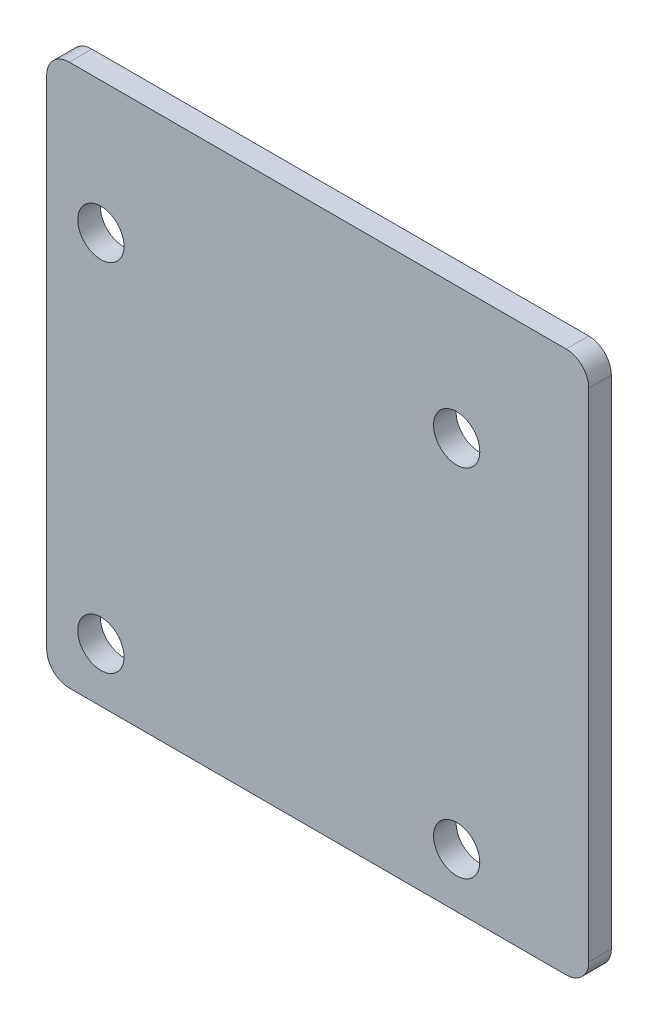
from build123d import *

# Parameters (mm, degrees)
EXTRUDE4_DEPTH          = 3.175
E_0_25_DIAMETER_HOLE1_D = 6.5024


with BuildPart() as part:
    # Sketch4 → Extrude4 (new body)
    with BuildSketch(Plane(origin=(0, 0, 0), x_dir=(-1, 0, 0), z_dir=(0, 0, -1))):
        with BuildLine():
            Line((3.175, -38.1), (73.025, -38.1))
            ThreePointArc((73.025, -38.1), (75.27006403, -37.17006403), (76.2, -34.925))
            Line((76.2, -34.925), (76.2, 34.925))
            ThreePointArc((76.2, 34.925), (75.27006403, 37.17006403), (73.025, 38.1))
            Line((73.025, 38.1), (3.175, 38.1))
            ThreePointArc((3.175, 38.1), (0.92993597, 37.17006403), (0, 34.925))
            Line((0, 34.925), (0, -34.925))
            ThreePointArc((0, -34.925), (0.92993597, -37.17006403), (3.175, -38.1))
        make_face()
    extrude(amount=EXTRUDE4_DEPTH)

    # E _0.25_ Diameter Hole1 (through all)
    with Locations(Plane.XY):
        with Locations((-18.5674, -30.48), (-18.5674, 19.5326), (-68.58, 19.5326), (-68.58, -30.48)):
            Hole(E_0_25_DIAMETER_HOLE1_D / 2)


solid = part.part
